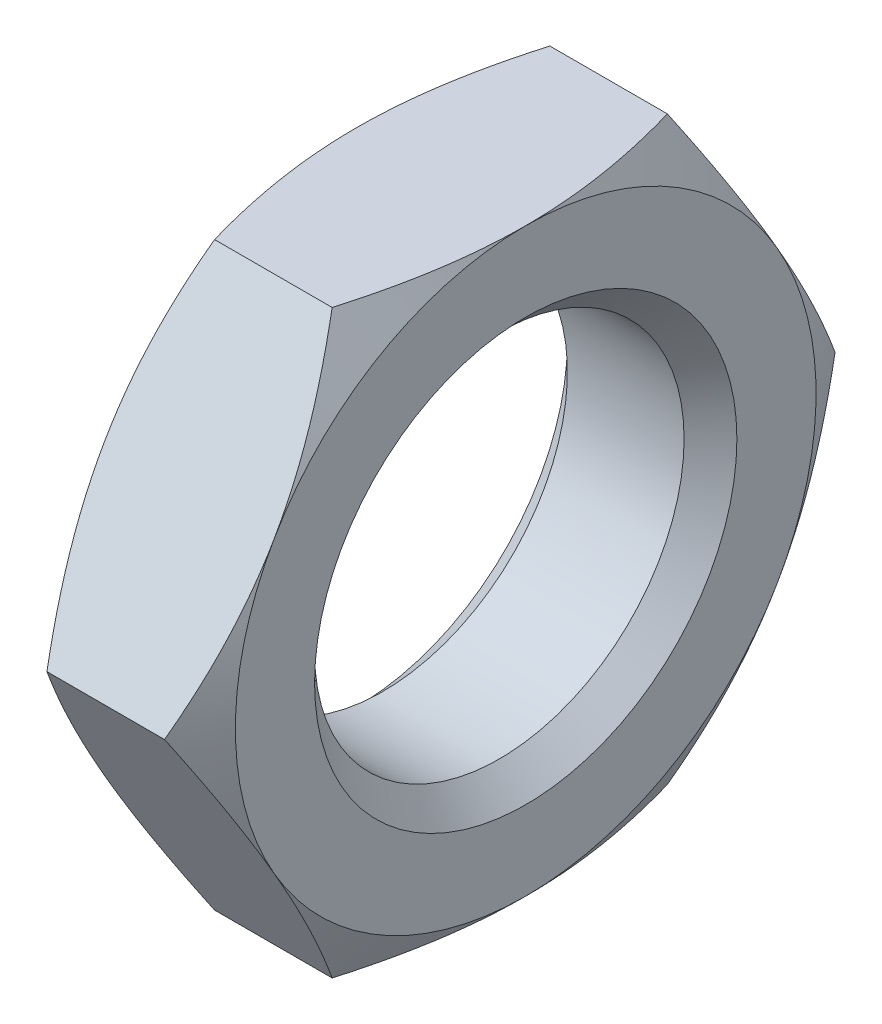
ISO-10303-21;
HEADER;
FILE_DESCRIPTION(('STEP AP214'),'2;1');
FILE_NAME('part.step','',(''),(''),'','','');
FILE_SCHEMA(('AUTOMOTIVE_DESIGN { 1 0 10303 214 1 1 1 1 }'));
ENDSEC;
DATA;
#1=APPLICATION_CONTEXT('core data for automotive mechanical design processes');
#2=APPLICATION_PROTOCOL_DEFINITION('international standard','automotive_design',2000,#1);
#3=PRODUCT_CONTEXT('',#1,'mechanical');
#4=PRODUCT('Part','Part','',(#3));
#5=PRODUCT_RELATED_PRODUCT_CATEGORY('part','',(#4));
#6=PRODUCT_DEFINITION_FORMATION('','',#4);
#7=PRODUCT_DEFINITION_CONTEXT('part definition',#1,'design');
#8=PRODUCT_DEFINITION('design','',#6,#7);
#9=PRODUCT_DEFINITION_SHAPE('','',#8);
#10=(LENGTH_UNIT() NAMED_UNIT(*) SI_UNIT(.MILLI.,.METRE.));
#11=(NAMED_UNIT(*) PLANE_ANGLE_UNIT() SI_UNIT($,.RADIAN.));
#12=(NAMED_UNIT(*) SI_UNIT($,.STERADIAN.) SOLID_ANGLE_UNIT());
#13=UNCERTAINTY_MEASURE_WITH_UNIT(LENGTH_MEASURE(1.E-05),#10,'distance_accuracy_value','');
#14=(GEOMETRIC_REPRESENTATION_CONTEXT(3) GLOBAL_UNCERTAINTY_ASSIGNED_CONTEXT((#13)) GLOBAL_UNIT_ASSIGNED_CONTEXT((#10,
#11,#12)) REPRESENTATION_CONTEXT('',''));
#15=CARTESIAN_POINT('',(0.,0.,0.));
#16=DIRECTION('',(0.,0.,1.));
#17=DIRECTION('',(1.,0.,0.));
#18=AXIS2_PLACEMENT_3D('',#15,#16,#17);
#19=CARTESIAN_POINT('',(6.42,11.,-6.35085296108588));
#20=DIRECTION('',(1.,0.,0.));
#21=DIRECTION('',(0.,0.,-1.));
#22=AXIS2_PLACEMENT_3D('',#19,#20,#21);
#23=PLANE('',#22);
#24=CARTESIAN_POINT('',(6.42,0.,0.));
#25=DIRECTION('',(1.,0.,0.));
#26=DIRECTION('',(0.,0.,-1.));
#27=AXIS2_PLACEMENT_3D('',#24,#25,#26);
#28=CIRCLE('',#27,8.00000000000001);
#29=CARTESIAN_POINT('',(6.42,0.,-8.00000000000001));
#30=VERTEX_POINT('',#29);
#31=EDGE_CURVE('E11',#30,#30,#28,.F.);
#32=ORIENTED_EDGE('',*,*,#31,.T.);
#33=EDGE_LOOP('',(#32));
#34=FACE_BOUND('',#33,.T.);
#35=CARTESIAN_POINT('',(6.42,0.,0.));
#36=DIRECTION('',(1.,0.,0.));
#37=DIRECTION('',(0.,0.,-1.));
#38=AXIS2_PLACEMENT_3D('',#35,#36,#37);
#39=CIRCLE('',#38,11.);
#40=CARTESIAN_POINT('',(6.42,-11.,0.));
#41=VERTEX_POINT('',#40);
#42=CARTESIAN_POINT('',(6.42,-5.50000000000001,-9.52627944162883));
#43=VERTEX_POINT('',#42);
#44=EDGE_CURVE('E142',#41,#43,#39,.T.);
#45=ORIENTED_EDGE('',*,*,#44,.T.);
#46=CARTESIAN_POINT('',(6.42,5.5,-9.52627944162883));
#47=VERTEX_POINT('',#46);
#48=EDGE_CURVE('E130',#43,#47,#39,.T.);
#49=ORIENTED_EDGE('',*,*,#48,.T.);
#50=CARTESIAN_POINT('',(6.42,11.,0.));
#51=VERTEX_POINT('',#50);
#52=EDGE_CURVE('E144',#47,#51,#39,.T.);
#53=ORIENTED_EDGE('',*,*,#52,.T.);
#54=CARTESIAN_POINT('',(6.42,5.5,9.52627944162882));
#55=VERTEX_POINT('',#54);
#56=EDGE_CURVE('E55',#51,#55,#39,.T.);
#57=ORIENTED_EDGE('',*,*,#56,.T.);
#58=CARTESIAN_POINT('',(6.42,-5.5,9.52627944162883));
#59=VERTEX_POINT('',#58);
#60=EDGE_CURVE('E63',#55,#59,#39,.T.);
#61=ORIENTED_EDGE('',*,*,#60,.T.);
#62=EDGE_CURVE('E166',#59,#41,#39,.T.);
#63=ORIENTED_EDGE('',*,*,#62,.T.);
#64=EDGE_LOOP('',(#45,#49,#53,#57,#61,#63));
#65=FACE_BOUND('',#64,.T.);
#66=ADVANCED_FACE('F39',(#34,#65),#23,.T.);
#67=CARTESIAN_POINT('',(0.,11.,-6.35085296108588));
#68=DIRECTION('',(1.,0.,0.));
#69=DIRECTION('',(0.,0.,-1.));
#70=AXIS2_PLACEMENT_3D('',#67,#68,#69);
#71=PLANE('',#70);
#72=CARTESIAN_POINT('',(0.,0.,0.));
#73=DIRECTION('',(1.,0.,0.));
#74=DIRECTION('',(0.,0.,-1.));
#75=AXIS2_PLACEMENT_3D('',#72,#73,#74);
#76=CIRCLE('',#75,7.99999999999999);
#77=CARTESIAN_POINT('',(0.,0.,-7.99999999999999));
#78=VERTEX_POINT('',#77);
#79=EDGE_CURVE('E164',#78,#78,#76,.T.);
#80=ORIENTED_EDGE('',*,*,#79,.T.);
#81=EDGE_LOOP('',(#80));
#82=FACE_BOUND('',#81,.T.);
#83=CARTESIAN_POINT('',(0.,0.,0.));
#84=DIRECTION('',(1.,0.,0.));
#85=DIRECTION('',(0.,0.,-1.));
#86=AXIS2_PLACEMENT_3D('',#83,#84,#85);
#87=CIRCLE('',#86,11.);
#88=CARTESIAN_POINT('',(0.,-5.5,-9.52627944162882));
#89=VERTEX_POINT('',#88);
#90=CARTESIAN_POINT('',(0.,5.50000000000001,-9.52627944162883));
#91=VERTEX_POINT('',#90);
#92=EDGE_CURVE('E173',#89,#91,#87,.T.);
#93=ORIENTED_EDGE('',*,*,#92,.F.);
#94=CARTESIAN_POINT('',(0.,-11.,0.));
#95=VERTEX_POINT('',#94);
#96=EDGE_CURVE('E321',#95,#89,#87,.T.);
#97=ORIENTED_EDGE('',*,*,#96,.F.);
#98=CARTESIAN_POINT('',(0.,-5.5,9.52627944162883));
#99=VERTEX_POINT('',#98);
#100=EDGE_CURVE('E324',#99,#95,#87,.T.);
#101=ORIENTED_EDGE('',*,*,#100,.F.);
#102=CARTESIAN_POINT('',(0.,5.5,9.52627944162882));
#103=VERTEX_POINT('',#102);
#104=EDGE_CURVE('E327',#103,#99,#87,.T.);
#105=ORIENTED_EDGE('',*,*,#104,.F.);
#106=CARTESIAN_POINT('',(0.,11.,0.));
#107=VERTEX_POINT('',#106);
#108=EDGE_CURVE('E178',#107,#103,#87,.T.);
#109=ORIENTED_EDGE('',*,*,#108,.F.);
#110=EDGE_CURVE('E174',#91,#107,#87,.T.);
#111=ORIENTED_EDGE('',*,*,#110,.F.);
#112=EDGE_LOOP('',(#93,#97,#101,#105,#109,#111));
#113=FACE_BOUND('',#112,.T.);
#114=ADVANCED_FACE('F322',(#82,#113),#71,.F.);
#115=CARTESIAN_POINT('',(6.42,0.,0.));
#116=DIRECTION('',(-1.,0.,0.));
#117=DIRECTION('',(0.,0.,1.));
#118=AXIS2_PLACEMENT_3D('',#115,#116,#117);
#119=CYLINDRICAL_SURFACE('',#118,7.);
#120=CARTESIAN_POINT('',(0.999999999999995,0.,0.));
#121=DIRECTION('',(1.,0.,0.));
#122=DIRECTION('',(0.,0.,-1.));
#123=AXIS2_PLACEMENT_3D('',#120,#121,#122);
#124=CIRCLE('',#123,7.);
#125=CARTESIAN_POINT('',(0.999999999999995,0.,7.));
#126=VERTEX_POINT('',#125);
#127=EDGE_CURVE('E48',#126,#126,#124,.F.);
#128=CARTESIAN_POINT('',(5.41999999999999,0.,0.));
#129=DIRECTION('',(1.,0.,0.));
#130=DIRECTION('',(0.,0.,-1.));
#131=AXIS2_PLACEMENT_3D('',#128,#129,#130);
#132=CIRCLE('',#131,7.);
#133=CARTESIAN_POINT('',(5.41999999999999,0.,7.));
#134=VERTEX_POINT('',#133);
#135=EDGE_CURVE('E410',#134,#134,#132,.T.);
#136=CARTESIAN_POINT('',(0.999999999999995,0.,7.));
#137=CARTESIAN_POINT('',(1.04604166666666,0.,7.));
#138=CARTESIAN_POINT('',(1.09208333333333,0.,7.));
#139=CARTESIAN_POINT('',(1.18416666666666,0.,7.));
#140=CARTESIAN_POINT('',(1.23020833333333,0.,7.));
#141=CARTESIAN_POINT('',(1.32229166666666,0.,7.));
#142=CARTESIAN_POINT('',(1.36833333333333,0.,7.));
#143=CARTESIAN_POINT('',(1.46041666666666,0.,7.));
#144=CARTESIAN_POINT('',(1.50645833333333,0.,7.));
#145=CARTESIAN_POINT('',(1.59854166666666,0.,7.));
#146=CARTESIAN_POINT('',(1.64458333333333,0.,7.));
#147=CARTESIAN_POINT('',(1.73666666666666,0.,7.));
#148=CARTESIAN_POINT('',(1.78270833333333,0.,7.));
#149=CARTESIAN_POINT('',(1.87479166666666,0.,7.));
#150=CARTESIAN_POINT('',(1.92083333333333,0.,7.));
#151=CARTESIAN_POINT('',(2.01291666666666,0.,7.));
#152=CARTESIAN_POINT('',(2.05895833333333,0.,7.));
#153=CARTESIAN_POINT('',(2.15104166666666,0.,7.));
#154=CARTESIAN_POINT('',(2.19708333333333,0.,7.));
#155=CARTESIAN_POINT('',(2.28916666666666,0.,7.));
#156=CARTESIAN_POINT('',(2.33520833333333,0.,7.));
#157=CARTESIAN_POINT('',(2.42729166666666,0.,7.));
#158=CARTESIAN_POINT('',(2.47333333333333,0.,7.));
#159=CARTESIAN_POINT('',(2.56541666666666,0.,7.));
#160=CARTESIAN_POINT('',(2.61145833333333,0.,7.));
#161=CARTESIAN_POINT('',(2.70354166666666,0.,7.));
#162=CARTESIAN_POINT('',(2.74958333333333,0.,7.));
#163=CARTESIAN_POINT('',(2.84166666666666,0.,7.));
#164=CARTESIAN_POINT('',(2.88770833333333,0.,7.));
#165=CARTESIAN_POINT('',(2.97979166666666,0.,7.));
#166=CARTESIAN_POINT('',(3.02583333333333,0.,7.));
#167=CARTESIAN_POINT('',(3.11791666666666,0.,7.));
#168=CARTESIAN_POINT('',(3.16395833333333,0.,7.));
#169=CARTESIAN_POINT('',(3.25604166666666,0.,7.));
#170=CARTESIAN_POINT('',(3.30208333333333,0.,7.));
#171=CARTESIAN_POINT('',(3.39416666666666,0.,7.));
#172=CARTESIAN_POINT('',(3.44020833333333,0.,7.));
#173=CARTESIAN_POINT('',(3.53229166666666,0.,7.));
#174=CARTESIAN_POINT('',(3.57833333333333,0.,7.));
#175=CARTESIAN_POINT('',(3.67041666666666,0.,7.));
#176=CARTESIAN_POINT('',(3.71645833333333,0.,7.));
#177=CARTESIAN_POINT('',(3.80854166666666,0.,7.));
#178=CARTESIAN_POINT('',(3.85458333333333,0.,7.));
#179=CARTESIAN_POINT('',(3.94666666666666,0.,7.));
#180=CARTESIAN_POINT('',(3.99270833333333,0.,7.));
#181=CARTESIAN_POINT('',(4.08479166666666,0.,7.));
#182=CARTESIAN_POINT('',(4.13083333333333,0.,7.));
#183=CARTESIAN_POINT('',(4.22291666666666,0.,7.));
#184=CARTESIAN_POINT('',(4.26895833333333,0.,7.));
#185=CARTESIAN_POINT('',(4.36104166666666,0.,7.));
#186=CARTESIAN_POINT('',(4.40708333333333,0.,7.));
#187=CARTESIAN_POINT('',(4.49916666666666,0.,7.));
#188=CARTESIAN_POINT('',(4.54520833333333,0.,7.));
#189=CARTESIAN_POINT('',(4.63729166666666,0.,7.));
#190=CARTESIAN_POINT('',(4.68333333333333,0.,7.));
#191=CARTESIAN_POINT('',(4.77541666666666,0.,7.));
#192=CARTESIAN_POINT('',(4.82145833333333,0.,7.));
#193=CARTESIAN_POINT('',(4.91354166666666,0.,7.));
#194=CARTESIAN_POINT('',(4.95958333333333,0.,7.));
#195=CARTESIAN_POINT('',(5.05166666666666,0.,7.));
#196=CARTESIAN_POINT('',(5.09770833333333,0.,7.));
#197=CARTESIAN_POINT('',(5.18979166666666,0.,7.));
#198=CARTESIAN_POINT('',(5.23583333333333,0.,7.));
#199=CARTESIAN_POINT('',(5.32791666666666,0.,7.));
#200=CARTESIAN_POINT('',(5.37395833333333,0.,7.));
#201=CARTESIAN_POINT('',(5.41999999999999,0.,7.));
#202=B_SPLINE_CURVE_WITH_KNOTS('',3,(#136,#137,#138,#139,#140,#141,#142,#143,#144,#145,#146,
#147,#148,#149,#150,#151,#152,#153,#154,#155,#156,#157,#158,#159,#160,#161,#162,#163,#164,#165,
#166,#167,#168,#169,#170,#171,#172,#173,#174,#175,#176,#177,#178,#179,#180,#181,#182,#183,#184,
#185,#186,#187,#188,#189,#190,#191,#192,#193,#194,#195,#196,#197,#198,#199,#200,#201),
.UNSPECIFIED.,.F.,.F.,(4,2,2,2,2,2,2,2,2,2,2,2,2,2,2,2,2,2,2,2,2,2,2,2,2,2,2,2,2,2,2,2,4),(0.,
0.138125,0.27625,0.414375,0.5525,0.690625,0.82875,0.966875,1.105,1.243125,1.38125,1.519375,
1.6575,1.795625,1.93375,2.071875,2.21,2.348125,2.48625,2.624375,2.7625,2.900625,3.03875,
3.176875,3.315,3.453125,3.59125,3.729375,3.8675,4.005625,4.14375,4.281875,4.42),.UNSPECIFIED.);
#203=EDGE_CURVE('BSEAM234',#126,#134,#202,.T.);
#204=ORIENTED_EDGE('',*,*,#127,.T.);
#205=ORIENTED_EDGE('',*,*,#135,.T.);
#206=ORIENTED_EDGE('',*,*,#203,.T.);
#207=ORIENTED_EDGE('',*,*,#203,.F.);
#208=EDGE_LOOP('',(#204,#206,#205,#207));
#209=FACE_BOUND('',#208,.T.);
#210=ADVANCED_FACE('F234',(#209),#119,.F.);
#211=CARTESIAN_POINT('',(0.,0.,0.));
#212=DIRECTION('',(1.,0.,0.));
#213=DIRECTION('',(0.,0.,-1.));
#214=AXIS2_PLACEMENT_3D('',#211,#212,#213);
#215=CONICAL_SURFACE('',#214,11.,1.0471975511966);
#216=CARTESIAN_POINT('',(0.982547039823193,-11.0002,-6.35073749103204));
#217=CARTESIAN_POINT('',(0.901959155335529,-10.7583962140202,-6.49034297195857));
#218=CARTESIAN_POINT('',(0.825028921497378,-10.515690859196,-6.63046897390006));
#219=CARTESIAN_POINT('',(0.679498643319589,-10.0283338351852,-6.91184468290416));
#220=CARTESIAN_POINT('',(0.610901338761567,-9.78368155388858,-7.05309474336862));
#221=CARTESIAN_POINT('',(0.418936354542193,-9.0457826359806,-7.47912088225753));
#222=CARTESIAN_POINT('',(0.309747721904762,-8.54962304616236,-7.7655787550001));
#223=CARTESIAN_POINT('',(0.181714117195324,-7.80714296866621,-8.19424982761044));
#224=CARTESIAN_POINT('',(0.145242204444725,-7.56304065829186,-8.33518236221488));
#225=CARTESIAN_POINT('',(0.0840813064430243,-7.07370581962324,-8.61769996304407));
#226=CARTESIAN_POINT('',(0.0593925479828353,-6.82847326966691,-8.75928504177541));
#227=CARTESIAN_POINT('',(0.0224303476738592,-6.33759931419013,-9.04269125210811));
#228=CARTESIAN_POINT('',(0.0101421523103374,-6.0919587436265,-9.18451190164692));
#229=CARTESIAN_POINT('',(-0.00175707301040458,-5.60044998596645,-9.468284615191));
#230=CARTESIAN_POINT('',(-0.00136849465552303,-5.35458180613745,-9.61023667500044));
#231=CARTESIAN_POINT('',(0.011201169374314,-4.89492981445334,-9.87561687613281));
#232=CARTESIAN_POINT('',(0.0218490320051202,-4.68111322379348,-9.99906394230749));
#233=CARTESIAN_POINT('',(0.0525316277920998,-4.25397181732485,-10.2456741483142));
#234=CARTESIAN_POINT('',(0.0725670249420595,-4.04064703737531,-10.3688372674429));
#235=CARTESIAN_POINT('',(0.121675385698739,-3.6146051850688,-10.6148126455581));
#236=CARTESIAN_POINT('',(0.150755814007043,-3.4018887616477,-10.7376245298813));
#237=CARTESIAN_POINT('',(0.217443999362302,-2.97745318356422,-10.9826725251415));
#238=CARTESIAN_POINT('',(0.255052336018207,-2.76573409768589,-11.1049085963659));
#239=CARTESIAN_POINT('',(0.381619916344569,-2.12304886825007,-11.4759630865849));
#240=CARTESIAN_POINT('',(0.483199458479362,-1.69394387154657,-11.7237069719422));
#241=CARTESIAN_POINT('',(0.713743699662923,-0.842132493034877,-12.2155005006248));
#242=CARTESIAN_POINT('',(0.842654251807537,-0.419415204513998,-12.4595564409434));
#243=CARTESIAN_POINT('',(0.982547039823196,0.000200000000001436,-12.7018213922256));
#244=B_SPLINE_CURVE_WITH_KNOTS('',3,(#216,#217,#218,#219,#220,#221,#222,#223,#224,#225,#226,
#227,#228,#229,#230,#231,#232,#233,#234,#235,#236,#237,#238,#239,#240,#241,#242,#243),
.UNSPECIFIED.,.F.,.F.,(4,2,2,2,2,2,2,2,2,2,2,2,2,4),(0.,0.871755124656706,1.74379610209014,
3.49159027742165,4.34403665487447,5.19649943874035,6.0479468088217,6.89936787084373,
7.64056020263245,8.38180496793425,9.1236630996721,9.86557166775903,11.3820155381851,
12.8954827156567),.UNSPECIFIED.);
#245=CARTESIAN_POINT('',(0.982480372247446,0.,-12.7017059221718));
#246=VERTEX_POINT('',#245);
#247=EDGE_CURVE('E335',#89,#246,#244,.T.);
#248=ORIENTED_EDGE('',*,*,#247,.F.);
#249=ORIENTED_EDGE('',*,*,#92,.T.);
#250=CARTESIAN_POINT('',(0.982547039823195,-0.000199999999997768,-12.7018213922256));
#251=CARTESIAN_POINT('',(0.901959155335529,0.241603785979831,-12.5622159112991));
#252=CARTESIAN_POINT('',(0.825028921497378,0.484309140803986,-12.4220899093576));
#253=CARTESIAN_POINT('',(0.679498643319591,0.971666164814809,-12.1407142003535));
#254=CARTESIAN_POINT('',(0.61090133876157,1.21631844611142,-11.999464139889));
#255=CARTESIAN_POINT('',(0.418936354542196,1.9542173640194,-11.5734380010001));
#256=CARTESIAN_POINT('',(0.309747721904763,2.45037695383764,-11.2869801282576));
#257=CARTESIAN_POINT('',(0.181714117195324,3.19285703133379,-10.8583090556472));
#258=CARTESIAN_POINT('',(0.145242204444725,3.43695934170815,-10.7173765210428));
#259=CARTESIAN_POINT('',(0.0840813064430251,3.92629418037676,-10.4348589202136));
#260=CARTESIAN_POINT('',(0.0593925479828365,4.17152673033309,-10.2932738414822));
#261=CARTESIAN_POINT('',(0.02243034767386,4.66240068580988,-10.0098676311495));
#262=CARTESIAN_POINT('',(0.0101421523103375,4.90804125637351,-9.86804698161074));
#263=CARTESIAN_POINT('',(-0.00175707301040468,5.39955001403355,-9.58427426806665));
#264=CARTESIAN_POINT('',(-0.00136849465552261,5.64541819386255,-9.44232220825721));
#265=CARTESIAN_POINT('',(0.0112011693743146,6.10507018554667,-9.17694200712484));
#266=CARTESIAN_POINT('',(0.0218490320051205,6.31888677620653,-9.05349494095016));
#267=CARTESIAN_POINT('',(0.0525316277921,6.74602818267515,-8.80688473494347));
#268=CARTESIAN_POINT('',(0.07256702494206,6.95935296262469,-8.68372161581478));
#269=CARTESIAN_POINT('',(0.121675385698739,7.3853948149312,-8.43774623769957));
#270=CARTESIAN_POINT('',(0.150755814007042,7.5981112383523,-8.31493435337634));
#271=CARTESIAN_POINT('',(0.217443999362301,8.02254681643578,-8.0698863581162));
#272=CARTESIAN_POINT('',(0.255052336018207,8.23426590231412,-7.94765028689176));
#273=CARTESIAN_POINT('',(0.381619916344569,8.87695113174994,-7.57659579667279));
#274=CARTESIAN_POINT('',(0.483199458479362,9.30605612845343,-7.32885191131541));
#275=CARTESIAN_POINT('',(0.713743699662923,10.1578675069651,-6.8370583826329));
#276=CARTESIAN_POINT('',(0.842654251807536,10.580584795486,-6.59300244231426));
#277=CARTESIAN_POINT('',(0.982547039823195,11.0002,-6.35073749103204));
#278=B_SPLINE_CURVE_WITH_KNOTS('',3,(#250,#251,#252,#253,#254,#255,#256,#257,#258,#259,#260,
#261,#262,#263,#264,#265,#266,#267,#268,#269,#270,#271,#272,#273,#274,#275,#276,#277),
.UNSPECIFIED.,.F.,.F.,(4,2,2,2,2,2,2,2,2,2,2,2,2,4),(0.,0.871755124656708,1.74379610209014,
3.49159027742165,4.34403665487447,5.19649943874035,6.0479468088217,6.89936787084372,
7.64056020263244,8.38180496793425,9.1236630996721,9.86557166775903,11.3820155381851,
12.8954827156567),.UNSPECIFIED.);
#279=EDGE_CURVE('E215',#246,#91,#278,.T.);
#280=ORIENTED_EDGE('',*,*,#279,.F.);
#281=EDGE_LOOP('',(#248,#249,#280));
#282=FACE_BOUND('',#281,.T.);
#283=ADVANCED_FACE('F194',(#282),#215,.T.);
#284=ORIENTED_EDGE('',*,*,#96,.T.);
#285=CARTESIAN_POINT('',(0.982480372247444,-11.,-6.35085296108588));
#286=VERTEX_POINT('',#285);
#287=EDGE_CURVE('E156',#286,#89,#244,.T.);
#288=ORIENTED_EDGE('',*,*,#287,.F.);
#289=CARTESIAN_POINT('',(5.41450441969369,-11.,-17.1543260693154));
#290=CARTESIAN_POINT('',(5.29756728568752,-11.,-16.9137160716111));
#291=CARTESIAN_POINT('',(5.18120609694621,-11.,-16.6728262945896));
#292=CARTESIAN_POINT('',(4.94976586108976,-11.,-16.1904288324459));
#293=CARTESIAN_POINT('',(4.83468682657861,-11.,-15.9489211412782));
#294=CARTESIAN_POINT('',(4.49153861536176,-11.,-15.2233206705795));
#295=CARTESIAN_POINT('',(4.26559230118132,-11.,-14.7382202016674));
#296=CARTESIAN_POINT('',(3.81951265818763,-11.,-13.7622100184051));
#297=CARTESIAN_POINT('',(3.59941685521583,-11.,-13.2712831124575));
#298=CARTESIAN_POINT('',(3.16810209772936,-11.,-12.2855584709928));
#299=CARTESIAN_POINT('',(2.95688273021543,-11.,-11.7907609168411));
#300=CARTESIAN_POINT('',(2.53890093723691,-11.,-10.7801499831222));
#301=CARTESIAN_POINT('',(2.33251361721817,-11.,-10.2641806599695));
#302=CARTESIAN_POINT('',(1.93512913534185,-11.,-9.2262370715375));
#303=CARTESIAN_POINT('',(1.74413368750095,-11.,-8.70426214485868));
#304=CARTESIAN_POINT('',(1.38248046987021,-11.,-7.65444043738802));
#305=CARTESIAN_POINT('',(1.21178233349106,-11.,-7.1266076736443));
#306=CARTESIAN_POINT('',(0.896128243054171,-11.,-6.06332116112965));
#307=CARTESIAN_POINT('',(0.751164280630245,-11.,-5.52786983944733));
#308=CARTESIAN_POINT('',(0.558616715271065,-11.,-4.72037006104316));
#309=CARTESIAN_POINT('',(0.49871693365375,-11.,-4.45124120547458));
#310=CARTESIAN_POINT('',(0.387920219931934,-11.,-3.91112703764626));
#311=CARTESIAN_POINT('',(0.337023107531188,-11.,-3.64014176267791));
#312=CARTESIAN_POINT('',(0.24512419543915,-11.,-3.09649461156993));
#313=CARTESIAN_POINT('',(0.204122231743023,-11.,-2.8238327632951));
#314=CARTESIAN_POINT('',(0.132827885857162,-11.,-2.27711361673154));
#315=CARTESIAN_POINT('',(0.102535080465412,-11.,-2.00305637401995));
#316=CARTESIAN_POINT('',(0.0536460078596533,-11.,-1.45754881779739));
#317=CARTESIAN_POINT('',(0.0349003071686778,-11.,-1.18611197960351));
#318=CARTESIAN_POINT('',(0.00890949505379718,-11.,-0.642689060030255));
#319=CARTESIAN_POINT('',(0.00166419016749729,-11.,-0.370702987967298));
#320=CARTESIAN_POINT('',(-0.00115304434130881,-11.,0.173331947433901));
#321=CARTESIAN_POINT('',(0.00327503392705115,-11.,0.445380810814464));
#322=CARTESIAN_POINT('',(0.0236951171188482,-11.,0.989047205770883));
#323=CARTESIAN_POINT('',(0.039687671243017,-11.,1.26066471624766));
#324=CARTESIAN_POINT('',(0.0914497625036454,-11.,1.91059229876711));
#325=CARTESIAN_POINT('',(0.132547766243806,-11.,2.28848722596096));
#326=CARTESIAN_POINT('',(0.234907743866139,-11.,3.0415166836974));
#327=CARTESIAN_POINT('',(0.296172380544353,-11.,3.41665084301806));
#328=CARTESIAN_POINT('',(0.506971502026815,-11.,4.53745976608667));
#329=CARTESIAN_POINT('',(0.683474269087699,-11.,5.27813200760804));
#330=CARTESIAN_POINT('',(0.990112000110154,-11.,6.38572900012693));
#331=CARTESIAN_POINT('',(1.10074350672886,-11.,6.7583843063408));
#332=CARTESIAN_POINT('',(1.33364120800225,-11.,7.50007701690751));
#333=CARTESIAN_POINT('',(1.45590748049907,-11.,7.86911439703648));
#334=CARTESIAN_POINT('',(1.71010110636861,-11.,8.60368413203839));
#335=CARTESIAN_POINT('',(1.84202537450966,-11.,8.96921756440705));
#336=CARTESIAN_POINT('',(2.11396847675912,-11.,9.69724662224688));
#337=CARTESIAN_POINT('',(2.25398720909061,-11.,10.0597422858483));
#338=CARTESIAN_POINT('',(2.59745413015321,-11.,10.9247708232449));
#339=CARTESIAN_POINT('',(2.80410126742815,-11.,11.4260312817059));
#340=CARTESIAN_POINT('',(3.22770231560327,-11.,12.4241916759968));
#341=CARTESIAN_POINT('',(3.44465690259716,-11.,12.9210913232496));
#342=CARTESIAN_POINT('',(3.88677852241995,-11.,13.9113565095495));
#343=CARTESIAN_POINT('',(4.11194751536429,-11.,14.4047211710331));
#344=CARTESIAN_POINT('',(4.56881488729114,-11.,15.3883964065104));
#345=CARTESIAN_POINT('',(4.80051311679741,-11.,15.8787070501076));
#346=CARTESIAN_POINT('',(5.26947068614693,-11.,16.8573519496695));
#347=CARTESIAN_POINT('',(5.5067361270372,-11.,17.3456832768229));
#348=CARTESIAN_POINT('',(5.98560771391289,-11.,18.3202126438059));
#349=CARTESIAN_POINT('',(6.22721387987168,-11.,18.8064106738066));
#350=CARTESIAN_POINT('',(6.71397943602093,-11.,19.776938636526));
#351=CARTESIAN_POINT('',(6.95913832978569,-11.,20.2612688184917));
#352=CARTESIAN_POINT('',(7.45245334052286,-11.,21.2284012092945));
#353=CARTESIAN_POINT('',(7.70060946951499,-11.,21.7112034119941));
#354=CARTESIAN_POINT('',(8.40600546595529,-11.,23.0748433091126));
#355=CARTESIAN_POINT('',(8.86618755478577,-11.,23.9541589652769));
#356=CARTESIAN_POINT('',(9.79280986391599,-11.,25.7095213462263));
#357=CARTESIAN_POINT('',(10.259250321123,-11.,26.5855679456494));
#358=CARTESIAN_POINT('',(11.195689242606,-11.,28.3328196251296));
#359=CARTESIAN_POINT('',(11.6656752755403,-11.,29.2040313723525));
#360=CARTESIAN_POINT('',(12.3734262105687,-11.,30.5093118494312));
#361=CARTESIAN_POINT('',(12.6097984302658,-11.,30.9441368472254));
#362=CARTESIAN_POINT('',(13.0833739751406,-11.,31.8133331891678));
#363=CARTESIAN_POINT('',(13.3205772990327,-11.,32.2477045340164));
#364=CARTESIAN_POINT('',(13.5581479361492,-11.,32.6818749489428));
#365=B_SPLINE_CURVE_WITH_KNOTS('',3,(#289,#290,#291,#292,#293,#294,#295,#296,#297,#298,#299,
#300,#301,#302,#303,#304,#305,#306,#307,#308,#309,#310,#311,#312,#313,#314,#315,#316,#317,#318,
#319,#320,#321,#322,#323,#324,#325,#326,#327,#328,#329,#330,#331,#332,#333,#334,#335,#336,#337,
#338,#339,#340,#341,#342,#343,#344,#345,#346,#347,#348,#349,#350,#351,#352,#353,#354,#355,#356,
#357,#358,#359,#360,#361,#362,#363,#364),.UNSPECIFIED.,.F.,.F.,(4,2,2,2,2,2,2,2,2,2,2,2,2,2,2,2,
2,2,2,2,2,2,2,2,2,2,2,2,2,2,2,2,2,2,2,2,2,4),(0.,0.802561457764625,1.60513079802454,
3.21050209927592,4.8244541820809,6.43833108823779,8.10529101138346,9.77243630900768,
11.4362085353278,13.0994620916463,13.9264785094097,14.7534783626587,15.5804645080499,
16.4074179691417,17.2234315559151,18.0394314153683,18.8554318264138,19.6714709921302,
20.8111983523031,21.9510762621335,24.2320584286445,25.3981500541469,26.5642494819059,
27.7299780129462,28.8956918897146,30.5220914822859,32.1485979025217,33.7754950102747,
35.4023549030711,37.0310896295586,38.6598318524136,40.2883486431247,41.9168719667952,
44.894193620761,47.87162829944,50.841308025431,52.3260637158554,53.8108171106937),.UNSPECIFIED.);
#366=EDGE_CURVE('E177',#95,#286,#365,.F.);
#367=ORIENTED_EDGE('',*,*,#366,.F.);
#368=EDGE_LOOP('',(#284,#288,#367));
#369=FACE_BOUND('',#368,.T.);
#370=ADVANCED_FACE('F354',(#369),#215,.T.);
#371=CARTESIAN_POINT('',(3.21,0.,0.));
#372=DIRECTION('',(-1.,0.,0.));
#373=DIRECTION('',(0.,0.,1.));
#374=AXIS2_PLACEMENT_3D('',#371,#372,#373);
#375=CONICAL_SURFACE('',#374,16.5598830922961,1.0471975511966);
#376=CARTESIAN_POINT('',(5.4374529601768,0.000200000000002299,-12.7018213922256));
#377=CARTESIAN_POINT('',(5.51804084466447,-0.241603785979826,-12.5622159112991));
#378=CARTESIAN_POINT('',(5.59497107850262,-0.484309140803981,-12.4220899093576));
#379=CARTESIAN_POINT('',(5.74050135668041,-0.971666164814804,-12.1407142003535));
#380=CARTESIAN_POINT('',(5.80909866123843,-1.21631844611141,-11.999464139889));
#381=CARTESIAN_POINT('',(6.0010636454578,-1.9542173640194,-11.5734380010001));
#382=CARTESIAN_POINT('',(6.11025227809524,-2.45037695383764,-11.2869801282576));
#383=CARTESIAN_POINT('',(6.23828588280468,-3.19285703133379,-10.8583090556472));
#384=CARTESIAN_POINT('',(6.27475779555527,-3.43695934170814,-10.7173765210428));
#385=CARTESIAN_POINT('',(6.33591869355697,-3.92629418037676,-10.4348589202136));
#386=CARTESIAN_POINT('',(6.36060745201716,-4.17152673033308,-10.2932738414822));
#387=CARTESIAN_POINT('',(6.39756965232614,-4.66240068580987,-10.0098676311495));
#388=CARTESIAN_POINT('',(6.40985784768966,-4.9080412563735,-9.86804698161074));
#389=CARTESIAN_POINT('',(6.4217570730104,-5.39955001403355,-9.58427426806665));
#390=CARTESIAN_POINT('',(6.42136849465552,-5.64541819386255,-9.44232220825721));
#391=CARTESIAN_POINT('',(6.40879883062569,-6.10507018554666,-9.17694200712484));
#392=CARTESIAN_POINT('',(6.39815096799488,-6.31888677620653,-9.05349494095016));
#393=CARTESIAN_POINT('',(6.3674683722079,-6.74602818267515,-8.80688473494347));
#394=CARTESIAN_POINT('',(6.34743297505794,-6.95935296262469,-8.68372161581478));
#395=CARTESIAN_POINT('',(6.29832461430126,-7.3853948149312,-8.43774623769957));
#396=CARTESIAN_POINT('',(6.26924418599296,-7.5981112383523,-8.31493435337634));
#397=CARTESIAN_POINT('',(6.2025560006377,-8.02254681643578,-8.06988635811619));
#398=CARTESIAN_POINT('',(6.16494766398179,-8.23426590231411,-7.94765028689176));
#399=CARTESIAN_POINT('',(6.03838008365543,-8.87695113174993,-7.57659579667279));
#400=CARTESIAN_POINT('',(5.93680054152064,-9.30605612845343,-7.32885191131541));
#401=CARTESIAN_POINT('',(5.70625630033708,-10.1578675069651,-6.8370583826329));
#402=CARTESIAN_POINT('',(5.57734574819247,-10.580584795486,-6.59300244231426));
#403=CARTESIAN_POINT('',(5.43745296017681,-11.0002,-6.35073749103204));
#404=B_SPLINE_CURVE_WITH_KNOTS('',3,(#376,#377,#378,#379,#380,#381,#382,#383,#384,#385,#386,
#387,#388,#389,#390,#391,#392,#393,#394,#395,#396,#397,#398,#399,#400,#401,#402,#403),
.UNSPECIFIED.,.F.,.F.,(4,2,2,2,2,2,2,2,2,2,2,2,2,4),(0.,0.871755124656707,1.74379610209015,
3.49159027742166,4.34403665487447,5.19649943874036,6.0479468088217,6.89936787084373,
7.64056020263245,8.38180496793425,9.12366309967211,9.86557166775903,11.3820155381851,
12.8954827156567),.UNSPECIFIED.);
#405=CARTESIAN_POINT('',(5.43751962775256,-11.,-6.35085296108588));
#406=VERTEX_POINT('',#405);
#407=EDGE_CURVE('E147',#43,#406,#404,.T.);
#408=ORIENTED_EDGE('',*,*,#407,.F.);
#409=ORIENTED_EDGE('',*,*,#44,.F.);
#410=CARTESIAN_POINT('',(1.00549558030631,-11.,-17.1543260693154));
#411=CARTESIAN_POINT('',(1.12243271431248,-11.,-16.9137160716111));
#412=CARTESIAN_POINT('',(1.23879390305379,-11.,-16.6728262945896));
#413=CARTESIAN_POINT('',(1.47023413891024,-11.,-16.1904288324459));
#414=CARTESIAN_POINT('',(1.58531317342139,-11.,-15.9489211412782));
#415=CARTESIAN_POINT('',(1.92846138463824,-11.,-15.2233206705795));
#416=CARTESIAN_POINT('',(2.15440769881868,-11.,-14.7382202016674));
#417=CARTESIAN_POINT('',(2.60048734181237,-11.,-13.7622100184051));
#418=CARTESIAN_POINT('',(2.82058314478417,-11.,-13.2712831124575));
#419=CARTESIAN_POINT('',(3.25189790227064,-11.,-12.2855584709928));
#420=CARTESIAN_POINT('',(3.46311726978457,-11.,-11.7907609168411));
#421=CARTESIAN_POINT('',(3.88109906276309,-11.,-10.7801499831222));
#422=CARTESIAN_POINT('',(4.08748638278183,-11.,-10.2641806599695));
#423=CARTESIAN_POINT('',(4.48487086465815,-11.,-9.2262370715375));
#424=CARTESIAN_POINT('',(4.67586631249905,-11.,-8.70426214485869));
#425=CARTESIAN_POINT('',(5.03751953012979,-11.,-7.65444043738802));
#426=CARTESIAN_POINT('',(5.20821766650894,-11.,-7.1266076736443));
#427=CARTESIAN_POINT('',(5.52387175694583,-11.,-6.06332116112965));
#428=CARTESIAN_POINT('',(5.66883571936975,-11.,-5.52786983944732));
#429=CARTESIAN_POINT('',(5.86138328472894,-11.,-4.72037006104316));
#430=CARTESIAN_POINT('',(5.92128306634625,-11.,-4.45124120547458));
#431=CARTESIAN_POINT('',(6.03207978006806,-11.,-3.91112703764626));
#432=CARTESIAN_POINT('',(6.08297689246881,-11.,-3.64014176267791));
#433=CARTESIAN_POINT('',(6.17487580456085,-11.,-3.09649461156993));
#434=CARTESIAN_POINT('',(6.21587776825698,-11.,-2.8238327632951));
#435=CARTESIAN_POINT('',(6.28717211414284,-11.,-2.27711361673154));
#436=CARTESIAN_POINT('',(6.31746491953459,-11.,-2.00305637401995));
#437=CARTESIAN_POINT('',(6.36635399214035,-11.,-1.45754881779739));
#438=CARTESIAN_POINT('',(6.38509969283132,-11.,-1.18611197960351));
#439=CARTESIAN_POINT('',(6.4110905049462,-11.,-0.642689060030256));
#440=CARTESIAN_POINT('',(6.4183358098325,-11.,-0.3707029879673));
#441=CARTESIAN_POINT('',(6.42115304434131,-11.,0.173331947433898));
#442=CARTESIAN_POINT('',(6.41672496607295,-11.,0.445380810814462));
#443=CARTESIAN_POINT('',(6.39630488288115,-11.,0.989047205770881));
#444=CARTESIAN_POINT('',(6.38031232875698,-11.,1.26066471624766));
#445=CARTESIAN_POINT('',(6.32855023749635,-11.,1.9105922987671));
#446=CARTESIAN_POINT('',(6.28745223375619,-11.,2.28848722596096));
#447=CARTESIAN_POINT('',(6.18509225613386,-11.,3.0415166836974));
#448=CARTESIAN_POINT('',(6.12382761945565,-11.,3.41665084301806));
#449=CARTESIAN_POINT('',(5.91302849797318,-11.,4.53745976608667));
#450=CARTESIAN_POINT('',(5.7365257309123,-11.,5.27813200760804));
#451=CARTESIAN_POINT('',(5.42988799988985,-11.,6.38572900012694));
#452=CARTESIAN_POINT('',(5.31925649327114,-11.,6.7583843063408));
#453=CARTESIAN_POINT('',(5.08635879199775,-11.,7.50007701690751));
#454=CARTESIAN_POINT('',(4.96409251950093,-11.,7.86911439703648));
#455=CARTESIAN_POINT('',(4.70989889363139,-11.,8.60368413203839));
#456=CARTESIAN_POINT('',(4.57797462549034,-11.,8.96921756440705));
#457=CARTESIAN_POINT('',(4.30603152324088,-11.,9.69724662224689));
#458=CARTESIAN_POINT('',(4.16601279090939,-11.,10.0597422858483));
#459=CARTESIAN_POINT('',(3.82254586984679,-11.,10.9247708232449));
#460=CARTESIAN_POINT('',(3.61589873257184,-11.,11.4260312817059));
#461=CARTESIAN_POINT('',(3.19229768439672,-11.,12.4241916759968));
#462=CARTESIAN_POINT('',(2.97534309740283,-11.,12.9210913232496));
#463=CARTESIAN_POINT('',(2.53322147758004,-11.,13.9113565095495));
#464=CARTESIAN_POINT('',(2.30805248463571,-11.,14.4047211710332));
#465=CARTESIAN_POINT('',(1.85118511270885,-11.,15.3883964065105));
#466=CARTESIAN_POINT('',(1.61948688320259,-11.,15.8787070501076));
#467=CARTESIAN_POINT('',(1.15052931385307,-11.,16.8573519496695));
#468=CARTESIAN_POINT('',(0.913263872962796,-11.,17.3456832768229));
#469=CARTESIAN_POINT('',(0.434392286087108,-11.,18.3202126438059));
#470=CARTESIAN_POINT('',(0.192786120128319,-11.,18.8064106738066));
#471=CARTESIAN_POINT('',(-0.293979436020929,-11.,19.776938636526));
#472=CARTESIAN_POINT('',(-0.539138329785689,-11.,20.2612688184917));
#473=CARTESIAN_POINT('',(-1.03245334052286,-11.,21.2284012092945));
#474=CARTESIAN_POINT('',(-1.28060946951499,-11.,21.7112034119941));
#475=CARTESIAN_POINT('',(-1.98600546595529,-11.,23.0748433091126));
#476=CARTESIAN_POINT('',(-2.44618755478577,-11.,23.9541589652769));
#477=CARTESIAN_POINT('',(-3.37280986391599,-11.,25.7095213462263));
#478=CARTESIAN_POINT('',(-3.83925032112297,-11.,26.5855679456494));
#479=CARTESIAN_POINT('',(-4.77568924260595,-11.,28.3328196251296));
#480=CARTESIAN_POINT('',(-5.2456752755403,-11.,29.2040313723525));
#481=CARTESIAN_POINT('',(-5.95342621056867,-11.,30.5093118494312));
#482=CARTESIAN_POINT('',(-6.1897984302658,-11.,30.9441368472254));
#483=CARTESIAN_POINT('',(-6.66337397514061,-11.,31.8133331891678));
#484=CARTESIAN_POINT('',(-6.90057729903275,-11.,32.2477045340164));
#485=CARTESIAN_POINT('',(-7.13814793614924,-11.,32.6818749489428));
#486=B_SPLINE_CURVE_WITH_KNOTS('',3,(#410,#411,#412,#413,#414,#415,#416,#417,#418,#419,#420,
#421,#422,#423,#424,#425,#426,#427,#428,#429,#430,#431,#432,#433,#434,#435,#436,#437,#438,#439,
#440,#441,#442,#443,#444,#445,#446,#447,#448,#449,#450,#451,#452,#453,#454,#455,#456,#457,#458,
#459,#460,#461,#462,#463,#464,#465,#466,#467,#468,#469,#470,#471,#472,#473,#474,#475,#476,#477,
#478,#479,#480,#481,#482,#483,#484,#485),.UNSPECIFIED.,.F.,.F.,(4,2,2,2,2,2,2,2,2,2,2,2,2,2,2,2,
2,2,2,2,2,2,2,2,2,2,2,2,2,2,2,2,2,2,2,2,2,4),(0.,0.802561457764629,1.60513079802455,
3.21050209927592,4.82445418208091,6.43833108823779,8.10529101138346,9.77243630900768,
11.4362085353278,13.0994620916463,13.9264785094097,14.7534783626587,15.5804645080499,
16.4074179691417,17.2234315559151,18.0394314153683,18.8554318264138,19.6714709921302,
20.8111983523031,21.9510762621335,24.2320584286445,25.3981500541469,26.5642494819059,
27.7299780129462,28.8956918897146,30.5220914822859,32.1485979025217,33.7754950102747,
35.4023549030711,37.0310896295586,38.6598318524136,40.2883486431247,41.9168719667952,
44.894193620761,47.87162829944,50.841308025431,52.3260637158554,53.8108171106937),.UNSPECIFIED.);
#487=EDGE_CURVE('E151',#406,#41,#486,.T.);
#488=ORIENTED_EDGE('',*,*,#487,.F.);
#489=EDGE_LOOP('',(#408,#409,#488));
#490=FACE_BOUND('',#489,.T.);
#491=ADVANCED_FACE('F148',(#490),#375,.T.);
#492=ORIENTED_EDGE('',*,*,#48,.F.);
#493=CARTESIAN_POINT('',(5.43751962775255,0.,-12.7017059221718));
#494=VERTEX_POINT('',#493);
#495=EDGE_CURVE('E134',#494,#43,#404,.T.);
#496=ORIENTED_EDGE('',*,*,#495,.F.);
#497=CARTESIAN_POINT('',(5.43745296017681,11.0002,-6.35073749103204));
#498=CARTESIAN_POINT('',(5.51804084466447,10.7583962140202,-6.49034297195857));
#499=CARTESIAN_POINT('',(5.59497107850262,10.515690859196,-6.63046897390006));
#500=CARTESIAN_POINT('',(5.74050135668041,10.0283338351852,-6.91184468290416));
#501=CARTESIAN_POINT('',(5.80909866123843,9.78368155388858,-7.05309474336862));
#502=CARTESIAN_POINT('',(6.0010636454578,9.0457826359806,-7.47912088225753));
#503=CARTESIAN_POINT('',(6.11025227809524,8.54962304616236,-7.7655787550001));
#504=CARTESIAN_POINT('',(6.23828588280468,7.80714296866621,-8.19424982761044));
#505=CARTESIAN_POINT('',(6.27475779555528,7.56304065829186,-8.33518236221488));
#506=CARTESIAN_POINT('',(6.33591869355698,7.07370581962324,-8.61769996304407));
#507=CARTESIAN_POINT('',(6.36060745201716,6.82847326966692,-8.75928504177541));
#508=CARTESIAN_POINT('',(6.39756965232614,6.33759931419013,-9.04269125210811));
#509=CARTESIAN_POINT('',(6.40985784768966,6.0919587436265,-9.18451190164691));
#510=CARTESIAN_POINT('',(6.4217570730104,5.60044998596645,-9.468284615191));
#511=CARTESIAN_POINT('',(6.42136849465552,5.35458180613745,-9.61023667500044));
#512=CARTESIAN_POINT('',(6.40879883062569,4.89492981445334,-9.87561687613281));
#513=CARTESIAN_POINT('',(6.39815096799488,4.68111322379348,-9.99906394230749));
#514=CARTESIAN_POINT('',(6.3674683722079,4.25397181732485,-10.2456741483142));
#515=CARTESIAN_POINT('',(6.34743297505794,4.04064703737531,-10.3688372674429));
#516=CARTESIAN_POINT('',(6.29832461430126,3.6146051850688,-10.6148126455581));
#517=CARTESIAN_POINT('',(6.26924418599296,3.4018887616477,-10.7376245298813));
#518=CARTESIAN_POINT('',(6.2025560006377,2.97745318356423,-10.9826725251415));
#519=CARTESIAN_POINT('',(6.16494766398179,2.76573409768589,-11.1049085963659));
#520=CARTESIAN_POINT('',(6.03838008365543,2.12304886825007,-11.4759630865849));
#521=CARTESIAN_POINT('',(5.93680054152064,1.69394387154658,-11.7237069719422));
#522=CARTESIAN_POINT('',(5.70625630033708,0.842132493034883,-12.2155005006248));
#523=CARTESIAN_POINT('',(5.57734574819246,0.419415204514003,-12.4595564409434));
#524=CARTESIAN_POINT('',(5.4374529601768,-0.000199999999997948,-12.7018213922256));
#525=B_SPLINE_CURVE_WITH_KNOTS('',3,(#497,#498,#499,#500,#501,#502,#503,#504,#505,#506,#507,
#508,#509,#510,#511,#512,#513,#514,#515,#516,#517,#518,#519,#520,#521,#522,#523,#524),
.UNSPECIFIED.,.F.,.F.,(4,2,2,2,2,2,2,2,2,2,2,2,2,4),(0.,0.871755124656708,1.74379610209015,
3.49159027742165,4.34403665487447,5.19649943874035,6.0479468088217,6.89936787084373,
7.64056020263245,8.38180496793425,9.1236630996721,9.86557166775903,11.3820155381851,
12.8954827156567),.UNSPECIFIED.);
#526=EDGE_CURVE('E136',#47,#494,#525,.T.);
#527=ORIENTED_EDGE('',*,*,#526,.F.);
#528=EDGE_LOOP('',(#492,#496,#527));
#529=FACE_BOUND('',#528,.T.);
#530=ADVANCED_FACE('F132',(#529),#375,.T.);
#531=ORIENTED_EDGE('',*,*,#100,.T.);
#532=CARTESIAN_POINT('',(0.982480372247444,-11.,6.35085296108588));
#533=VERTEX_POINT('',#532);
#534=EDGE_CURVE('E187',#533,#95,#365,.F.);
#535=ORIENTED_EDGE('',*,*,#534,.F.);
#536=CARTESIAN_POINT('',(0.982547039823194,0.000200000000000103,12.7018213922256));
#537=CARTESIAN_POINT('',(0.901959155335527,-0.241603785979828,12.5622159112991));
#538=CARTESIAN_POINT('',(0.825028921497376,-0.484309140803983,12.4220899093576));
#539=CARTESIAN_POINT('',(0.679498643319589,-0.971666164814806,12.1407142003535));
#540=CARTESIAN_POINT('',(0.610901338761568,-1.21631844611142,11.999464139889));
#541=CARTESIAN_POINT('',(0.418936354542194,-1.9542173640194,11.5734380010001));
#542=CARTESIAN_POINT('',(0.30974772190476,-2.45037695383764,11.2869801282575));
#543=CARTESIAN_POINT('',(0.181714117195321,-3.19285703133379,10.8583090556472));
#544=CARTESIAN_POINT('',(0.145242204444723,-3.43695934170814,10.7173765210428));
#545=CARTESIAN_POINT('',(0.0840813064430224,-3.92629418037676,10.4348589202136));
#546=CARTESIAN_POINT('',(0.0593925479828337,-4.17152673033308,10.2932738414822));
#547=CARTESIAN_POINT('',(0.0224303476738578,-4.66240068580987,10.0098676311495));
#548=CARTESIAN_POINT('',(0.0101421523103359,-4.9080412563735,9.86804698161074));
#549=CARTESIAN_POINT('',(-0.00175707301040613,-5.39955001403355,9.58427426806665));
#550=CARTESIAN_POINT('',(-0.00136849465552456,-5.64541819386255,9.44232220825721));
#551=CARTESIAN_POINT('',(0.0112011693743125,-6.10507018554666,9.17694200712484));
#552=CARTESIAN_POINT('',(0.0218490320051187,-6.31888677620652,9.05349494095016));
#553=CARTESIAN_POINT('',(0.0525316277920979,-6.74602818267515,8.80688473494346));
#554=CARTESIAN_POINT('',(0.0725670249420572,-6.95935296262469,8.68372161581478));
#555=CARTESIAN_POINT('',(0.121675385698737,-7.3853948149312,8.43774623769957));
#556=CARTESIAN_POINT('',(0.15075581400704,-7.5981112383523,8.31493435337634));
#557=CARTESIAN_POINT('',(0.217443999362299,-8.02254681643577,8.06988635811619));
#558=CARTESIAN_POINT('',(0.255052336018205,-8.23426590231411,7.94765028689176));
#559=CARTESIAN_POINT('',(0.381619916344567,-8.87695113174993,7.57659579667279));
#560=CARTESIAN_POINT('',(0.48319945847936,-9.30605612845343,7.32885191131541));
#561=CARTESIAN_POINT('',(0.713743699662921,-10.1578675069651,6.8370583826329));
#562=CARTESIAN_POINT('',(0.842654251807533,-10.580584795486,6.59300244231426));
#563=CARTESIAN_POINT('',(0.982547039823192,-11.0002,6.35073749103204));
#564=B_SPLINE_CURVE_WITH_KNOTS('',3,(#536,#537,#538,#539,#540,#541,#542,#543,#544,#545,#546,
#547,#548,#549,#550,#551,#552,#553,#554,#555,#556,#557,#558,#559,#560,#561,#562,#563),
.UNSPECIFIED.,.F.,.F.,(4,2,2,2,2,2,2,2,2,2,2,2,2,4),(0.,0.871755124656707,1.74379610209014,
3.49159027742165,4.34403665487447,5.19649943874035,6.0479468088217,6.89936787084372,
7.64056020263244,8.38180496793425,9.1236630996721,9.86557166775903,11.3820155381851,
12.8954827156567),.UNSPECIFIED.);
#565=EDGE_CURVE('E188',#99,#533,#564,.T.);
#566=ORIENTED_EDGE('',*,*,#565,.F.);
#567=EDGE_LOOP('',(#531,#535,#566));
#568=FACE_BOUND('',#567,.T.);
#569=ADVANCED_FACE('F353',(#568),#215,.T.);
#570=CARTESIAN_POINT('',(5.43751962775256,-11.,6.35085296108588));
#571=VERTEX_POINT('',#570);
#572=EDGE_CURVE('E216',#41,#571,#486,.T.);
#573=ORIENTED_EDGE('',*,*,#572,.F.);
#574=ORIENTED_EDGE('',*,*,#62,.F.);
#575=CARTESIAN_POINT('',(5.43745296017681,-11.0002,6.35073749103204));
#576=CARTESIAN_POINT('',(5.51804084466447,-10.7583962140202,6.49034297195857));
#577=CARTESIAN_POINT('',(5.59497107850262,-10.515690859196,6.63046897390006));
#578=CARTESIAN_POINT('',(5.74050135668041,-10.0283338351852,6.91184468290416));
#579=CARTESIAN_POINT('',(5.80909866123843,-9.78368155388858,7.05309474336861));
#580=CARTESIAN_POINT('',(6.00106364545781,-9.0457826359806,7.47912088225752));
#581=CARTESIAN_POINT('',(6.11025227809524,-8.54962304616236,7.7655787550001));
#582=CARTESIAN_POINT('',(6.23828588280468,-7.80714296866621,8.19424982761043));
#583=CARTESIAN_POINT('',(6.27475779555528,-7.56304065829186,8.33518236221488));
#584=CARTESIAN_POINT('',(6.33591869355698,-7.07370581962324,8.61769996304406));
#585=CARTESIAN_POINT('',(6.36060745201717,-6.82847326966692,8.75928504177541));
#586=CARTESIAN_POINT('',(6.39756965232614,-6.33759931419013,9.04269125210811));
#587=CARTESIAN_POINT('',(6.40985784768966,-6.0919587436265,9.18451190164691));
#588=CARTESIAN_POINT('',(6.42175707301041,-5.60044998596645,9.468284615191));
#589=CARTESIAN_POINT('',(6.42136849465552,-5.35458180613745,9.61023667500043));
#590=CARTESIAN_POINT('',(6.40879883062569,-4.89492981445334,9.87561687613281));
#591=CARTESIAN_POINT('',(6.39815096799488,-4.68111322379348,9.99906394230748));
#592=CARTESIAN_POINT('',(6.3674683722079,-4.25397181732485,10.2456741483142));
#593=CARTESIAN_POINT('',(6.34743297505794,-4.04064703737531,10.3688372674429));
#594=CARTESIAN_POINT('',(6.29832461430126,-3.6146051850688,10.6148126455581));
#595=CARTESIAN_POINT('',(6.26924418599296,-3.4018887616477,10.7376245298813));
#596=CARTESIAN_POINT('',(6.2025560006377,-2.97745318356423,10.9826725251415));
#597=CARTESIAN_POINT('',(6.16494766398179,-2.76573409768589,11.1049085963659));
#598=CARTESIAN_POINT('',(6.03838008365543,-2.12304886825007,11.4759630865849));
#599=CARTESIAN_POINT('',(5.93680054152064,-1.69394387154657,11.7237069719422));
#600=CARTESIAN_POINT('',(5.70625630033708,-0.842132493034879,12.2155005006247));
#601=CARTESIAN_POINT('',(5.57734574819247,-0.419415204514,12.4595564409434));
#602=CARTESIAN_POINT('',(5.43745296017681,0.000199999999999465,12.7018213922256));
#603=B_SPLINE_CURVE_WITH_KNOTS('',3,(#575,#576,#577,#578,#579,#580,#581,#582,#583,#584,#585,
#586,#587,#588,#589,#590,#591,#592,#593,#594,#595,#596,#597,#598,#599,#600,#601,#602),
.UNSPECIFIED.,.F.,.F.,(4,2,2,2,2,2,2,2,2,2,2,2,2,4),(0.,0.871755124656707,1.74379610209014,
3.49159027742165,4.34403665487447,5.19649943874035,6.0479468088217,6.89936787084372,
7.64056020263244,8.38180496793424,9.1236630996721,9.86557166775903,11.3820155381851,
12.8954827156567),.UNSPECIFIED.);
#604=EDGE_CURVE('E247',#571,#59,#603,.T.);
#605=ORIENTED_EDGE('',*,*,#604,.F.);
#606=EDGE_LOOP('',(#573,#574,#605));
#607=FACE_BOUND('',#606,.T.);
#608=ADVANCED_FACE('F395',(#607),#375,.T.);
#609=ORIENTED_EDGE('',*,*,#104,.T.);
#610=CARTESIAN_POINT('',(0.982480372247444,0.,12.7017059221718));
#611=VERTEX_POINT('',#610);
#612=EDGE_CURVE('E288',#611,#99,#564,.T.);
#613=ORIENTED_EDGE('',*,*,#612,.F.);
#614=CARTESIAN_POINT('',(0.982547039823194,11.0002,6.35073749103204));
#615=CARTESIAN_POINT('',(0.901959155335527,10.7583962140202,6.49034297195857));
#616=CARTESIAN_POINT('',(0.825028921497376,10.515690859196,6.63046897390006));
#617=CARTESIAN_POINT('',(0.679498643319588,10.0283338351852,6.91184468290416));
#618=CARTESIAN_POINT('',(0.610901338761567,9.78368155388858,7.05309474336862));
#619=CARTESIAN_POINT('',(0.418936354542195,9.0457826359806,7.47912088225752));
#620=CARTESIAN_POINT('',(0.309747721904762,8.54962304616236,7.7655787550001));
#621=CARTESIAN_POINT('',(0.181714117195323,7.80714296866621,8.19424982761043));
#622=CARTESIAN_POINT('',(0.145242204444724,7.56304065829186,8.33518236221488));
#623=CARTESIAN_POINT('',(0.084081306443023,7.07370581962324,8.61769996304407));
#624=CARTESIAN_POINT('',(0.059392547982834,6.82847326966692,8.75928504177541));
#625=CARTESIAN_POINT('',(0.0224303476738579,6.33759931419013,9.04269125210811));
#626=CARTESIAN_POINT('',(0.010142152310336,6.0919587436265,9.18451190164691));
#627=CARTESIAN_POINT('',(-0.00175707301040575,5.60044998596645,9.468284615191));
#628=CARTESIAN_POINT('',(-0.00136849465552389,5.35458180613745,9.61023667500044));
#629=CARTESIAN_POINT('',(0.0112011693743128,4.89492981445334,9.87561687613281));
#630=CARTESIAN_POINT('',(0.0218490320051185,4.68111322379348,9.99906394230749));
#631=CARTESIAN_POINT('',(0.0525316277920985,4.25397181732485,10.2456741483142));
#632=CARTESIAN_POINT('',(0.0725670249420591,4.04064703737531,10.3688372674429));
#633=CARTESIAN_POINT('',(0.121675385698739,3.6146051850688,10.6148126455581));
#634=CARTESIAN_POINT('',(0.150755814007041,3.4018887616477,10.7376245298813));
#635=CARTESIAN_POINT('',(0.2174439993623,2.97745318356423,10.9826725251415));
#636=CARTESIAN_POINT('',(0.255052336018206,2.76573409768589,11.1049085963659));
#637=CARTESIAN_POINT('',(0.381619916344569,2.12304886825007,11.4759630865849));
#638=CARTESIAN_POINT('',(0.483199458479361,1.69394387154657,11.7237069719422));
#639=CARTESIAN_POINT('',(0.71374369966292,0.842132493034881,12.2155005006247));
#640=CARTESIAN_POINT('',(0.842654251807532,0.419415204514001,12.4595564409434));
#641=CARTESIAN_POINT('',(0.982547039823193,-0.00019999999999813,12.7018213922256));
#642=B_SPLINE_CURVE_WITH_KNOTS('',3,(#614,#615,#616,#617,#618,#619,#620,#621,#622,#623,#624,
#625,#626,#627,#628,#629,#630,#631,#632,#633,#634,#635,#636,#637,#638,#639,#640,#641),
.UNSPECIFIED.,.F.,.F.,(4,2,2,2,2,2,2,2,2,2,2,2,2,4),(0.,0.871755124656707,1.74379610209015,
3.49159027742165,4.34403665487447,5.19649943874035,6.0479468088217,6.89936787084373,
7.64056020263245,8.38180496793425,9.1236630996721,9.86557166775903,11.3820155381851,
12.8954827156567),.UNSPECIFIED.);
#643=EDGE_CURVE('E282',#103,#611,#642,.T.);
#644=ORIENTED_EDGE('',*,*,#643,.F.);
#645=EDGE_LOOP('',(#609,#613,#644));
#646=FACE_BOUND('',#645,.T.);
#647=ADVANCED_FACE('F232',(#646),#215,.T.);
#648=CARTESIAN_POINT('',(5.43751962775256,0.,12.7017059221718));
#649=VERTEX_POINT('',#648);
#650=EDGE_CURVE('E380',#59,#649,#603,.T.);
#651=ORIENTED_EDGE('',*,*,#650,.F.);
#652=ORIENTED_EDGE('',*,*,#60,.F.);
#653=CARTESIAN_POINT('',(5.43745296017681,-0.000200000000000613,12.7018213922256));
#654=CARTESIAN_POINT('',(5.51804084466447,0.241603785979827,12.5622159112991));
#655=CARTESIAN_POINT('',(5.59497107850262,0.484309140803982,12.4220899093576));
#656=CARTESIAN_POINT('',(5.74050135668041,0.971666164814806,12.1407142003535));
#657=CARTESIAN_POINT('',(5.80909866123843,1.21631844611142,11.999464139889));
#658=CARTESIAN_POINT('',(6.00106364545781,1.9542173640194,11.5734380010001));
#659=CARTESIAN_POINT('',(6.11025227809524,2.45037695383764,11.2869801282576));
#660=CARTESIAN_POINT('',(6.23828588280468,3.19285703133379,10.8583090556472));
#661=CARTESIAN_POINT('',(6.27475779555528,3.43695934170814,10.7173765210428));
#662=CARTESIAN_POINT('',(6.33591869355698,3.92629418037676,10.4348589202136));
#663=CARTESIAN_POINT('',(6.36060745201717,4.17152673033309,10.2932738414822));
#664=CARTESIAN_POINT('',(6.39756965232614,4.66240068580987,10.0098676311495));
#665=CARTESIAN_POINT('',(6.40985784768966,4.9080412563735,9.86804698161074));
#666=CARTESIAN_POINT('',(6.42175707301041,5.39955001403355,9.58427426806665));
#667=CARTESIAN_POINT('',(6.42136849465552,5.64541819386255,9.44232220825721));
#668=CARTESIAN_POINT('',(6.40879883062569,6.10507018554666,9.17694200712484));
#669=CARTESIAN_POINT('',(6.39815096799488,6.31888677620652,9.05349494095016));
#670=CARTESIAN_POINT('',(6.3674683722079,6.74602818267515,8.80688473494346));
#671=CARTESIAN_POINT('',(6.34743297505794,6.95935296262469,8.68372161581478));
#672=CARTESIAN_POINT('',(6.29832461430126,7.3853948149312,8.43774623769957));
#673=CARTESIAN_POINT('',(6.26924418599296,7.5981112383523,8.31493435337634));
#674=CARTESIAN_POINT('',(6.2025560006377,8.02254681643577,8.0698863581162));
#675=CARTESIAN_POINT('',(6.16494766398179,8.23426590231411,7.94765028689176));
#676=CARTESIAN_POINT('',(6.03838008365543,8.87695113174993,7.57659579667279));
#677=CARTESIAN_POINT('',(5.93680054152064,9.30605612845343,7.32885191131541));
#678=CARTESIAN_POINT('',(5.70625630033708,10.1578675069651,6.8370583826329));
#679=CARTESIAN_POINT('',(5.57734574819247,10.580584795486,6.59300244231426));
#680=CARTESIAN_POINT('',(5.43745296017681,11.0002,6.35073749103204));
#681=B_SPLINE_CURVE_WITH_KNOTS('',3,(#653,#654,#655,#656,#657,#658,#659,#660,#661,#662,#663,
#664,#665,#666,#667,#668,#669,#670,#671,#672,#673,#674,#675,#676,#677,#678,#679,#680),
.UNSPECIFIED.,.F.,.F.,(4,2,2,2,2,2,2,2,2,2,2,2,2,4),(0.,0.871755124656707,1.74379610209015,
3.49159027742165,4.34403665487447,5.19649943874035,6.0479468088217,6.89936787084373,
7.64056020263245,8.38180496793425,9.1236630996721,9.86557166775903,11.3820155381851,
12.8954827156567),.UNSPECIFIED.);
#682=EDGE_CURVE('E375',#649,#55,#681,.T.);
#683=ORIENTED_EDGE('',*,*,#682,.F.);
#684=EDGE_LOOP('',(#651,#652,#683));
#685=FACE_BOUND('',#684,.T.);
#686=ADVANCED_FACE('F227',(#685),#375,.T.);
#687=ORIENTED_EDGE('',*,*,#108,.T.);
#688=CARTESIAN_POINT('',(0.982480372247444,11.,6.35085296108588));
#689=VERTEX_POINT('',#688);
#690=EDGE_CURVE('E281',#689,#103,#642,.T.);
#691=ORIENTED_EDGE('',*,*,#690,.F.);
#692=CARTESIAN_POINT('',(5.41450442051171,11.,-17.1543260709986));
#693=CARTESIAN_POINT('',(5.29756728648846,11.,-16.913716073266));
#694=CARTESIAN_POINT('',(5.18120609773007,11.,-16.6728262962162));
#695=CARTESIAN_POINT('',(4.94976586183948,11.,-16.1904288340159));
#696=CARTESIAN_POINT('',(4.83468682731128,11.,-15.9489211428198));
#697=CARTESIAN_POINT('',(4.49153861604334,11.,-15.2233206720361));
#698=CARTESIAN_POINT('',(4.26559230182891,11.,-14.7382202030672));
#699=CARTESIAN_POINT('',(3.81951265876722,11.,-13.7622100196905));
#700=CARTESIAN_POINT('',(3.59941685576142,11.,-13.2712831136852));
#701=CARTESIAN_POINT('',(3.1681020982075,11.,-12.2855584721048));
#702=CARTESIAN_POINT('',(2.95688273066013,11.,-11.790760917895));
#703=CARTESIAN_POINT('',(2.5389009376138,11.,-10.7801499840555));
#704=CARTESIAN_POINT('',(2.33251361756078,11.,-10.2641806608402));
#705=CARTESIAN_POINT('',(1.93512913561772,11.,-9.22623707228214));
#706=CARTESIAN_POINT('',(1.74413368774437,11.,-8.70426214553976));
#707=CARTESIAN_POINT('',(1.38248047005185,11.,-7.65444043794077));
#708=CARTESIAN_POINT('',(1.21178233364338,11.,-7.12660767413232));
#709=CARTESIAN_POINT('',(0.896128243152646,11.,-6.06332116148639));
#710=CARTESIAN_POINT('',(0.751164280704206,11.,-5.52786983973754));
#711=CARTESIAN_POINT('',(0.558616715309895,11.,-4.72037006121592));
#712=CARTESIAN_POINT('',(0.498716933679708,11.,-4.45124120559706));
#713=CARTESIAN_POINT('',(0.387920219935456,11.,-3.91112703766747));
#714=CARTESIAN_POINT('',(0.337023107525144,11.,-3.64014176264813));
#715=CARTESIAN_POINT('',(0.245124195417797,11.,-3.09649461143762));
#716=CARTESIAN_POINT('',(0.204122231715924,11.,-2.82383276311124));
#717=CARTESIAN_POINT('',(0.132827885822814,11.,-2.27711361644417));
#718=CARTESIAN_POINT('',(0.102535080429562,11.,-2.0030563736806));
#719=CARTESIAN_POINT('',(0.0536460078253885,11.,-1.45754881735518));
#720=CARTESIAN_POINT('',(0.0349003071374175,11.,-1.18611197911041));
#721=CARTESIAN_POINT('',(0.00890949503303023,11.,-0.642689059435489));
#722=CARTESIAN_POINT('',(0.00166419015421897,11.,-0.370702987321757));
#723=CARTESIAN_POINT('',(-0.00115304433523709,11.,0.173331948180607));
#724=CARTESIAN_POINT('',(0.00327503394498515,11.,0.445380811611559));
#725=CARTESIAN_POINT('',(0.0236951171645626,11.,0.989047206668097));
#726=CARTESIAN_POINT('',(0.0396876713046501,11.,1.26066471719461));
#727=CARTESIAN_POINT('',(0.0914497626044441,11.,1.91059229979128));
#728=CARTESIAN_POINT('',(0.132547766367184,11.,2.28848722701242));
#729=CARTESIAN_POINT('',(0.234907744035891,11.,3.0415166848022));
#730=CARTESIAN_POINT('',(0.2961723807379,11.,3.41665084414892));
#731=CARTESIAN_POINT('',(0.506971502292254,11.,4.5374597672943));
#732=CARTESIAN_POINT('',(0.68347426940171,11.,5.27813200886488));
#733=CARTESIAN_POINT('',(0.99011200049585,11.,6.38572900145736));
#734=CARTESIAN_POINT('',(1.1007435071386,11.,6.75838430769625));
#735=CARTESIAN_POINT('',(1.33364120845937,11.,7.50007701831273));
#736=CARTESIAN_POINT('',(1.45590748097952,11.,7.86911439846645));
#737=CARTESIAN_POINT('',(1.7101011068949,11.,8.60368413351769));
#738=CARTESIAN_POINT('',(1.84202537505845,11.,8.96921756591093));
#739=CARTESIAN_POINT('',(2.11396847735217,11.,9.69724662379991));
#740=CARTESIAN_POINT('',(2.25398720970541,11.,10.0597422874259));
#741=CARTESIAN_POINT('',(2.59745413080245,11.,10.9247708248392));
#742=CARTESIAN_POINT('',(2.80410126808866,11.,11.4260312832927));
#743=CARTESIAN_POINT('',(3.22770231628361,11.,12.4241916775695));
#744=CARTESIAN_POINT('',(3.44465690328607,11.,12.9210913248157));
#745=CARTESIAN_POINT('',(3.88677852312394,11.,13.9113565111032));
#746=CARTESIAN_POINT('',(4.11194751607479,11.,14.4047211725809));
#747=CARTESIAN_POINT('',(4.56881488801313,11.,15.388396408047));
#748=CARTESIAN_POINT('',(4.80051311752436,11.,15.8787070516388));
#749=CARTESIAN_POINT('',(5.26947068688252,11.,16.8573519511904));
#750=CARTESIAN_POINT('',(5.50673612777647,11.,17.3456832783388));
#751=CARTESIAN_POINT('',(5.98560771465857,11.,18.3202126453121));
#752=CARTESIAN_POINT('',(6.22721388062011,11.,18.806410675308));
#753=CARTESIAN_POINT('',(6.71397943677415,11.,19.7769386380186));
#754=CARTESIAN_POINT('',(6.95913833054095,11.,20.26126881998));
#755=CARTESIAN_POINT('',(7.45245334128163,11.,21.2284012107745));
#756=CARTESIAN_POINT('',(7.70060947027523,11.,21.7112034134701));
#757=CARTESIAN_POINT('',(8.40600546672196,11.,23.0748433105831));
#758=CARTESIAN_POINT('',(8.86618755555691,11.,23.9541589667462));
#759=CARTESIAN_POINT('',(9.79280986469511,11.,25.7095213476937));
#760=CARTESIAN_POINT('',(10.2592503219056,11.,26.5855679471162));
#761=CARTESIAN_POINT('',(11.1956892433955,11.,28.3328196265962));
#762=CARTESIAN_POINT('',(11.6656752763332,11.,29.2040313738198));
#763=CARTESIAN_POINT('',(12.3734262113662,11.,30.5093118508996));
#764=CARTESIAN_POINT('',(12.6097984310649,11.,30.9441368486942));
#765=CARTESIAN_POINT('',(13.0833739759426,11.,31.8133331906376));
#766=CARTESIAN_POINT('',(13.3205772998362,11.,32.2477045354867));
#767=CARTESIAN_POINT('',(13.558147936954,11.,32.6818749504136));
#768=B_SPLINE_CURVE_WITH_KNOTS('',3,(#692,#693,#694,#695,#696,#697,#698,#699,#700,#701,#702,
#703,#704,#705,#706,#707,#708,#709,#710,#711,#712,#713,#714,#715,#716,#717,#718,#719,#720,#721,
#722,#723,#724,#725,#726,#727,#728,#729,#730,#731,#732,#733,#734,#735,#736,#737,#738,#739,#740,
#741,#742,#743,#744,#745,#746,#747,#748,#749,#750,#751,#752,#753,#754,#755,#756,#757,#758,#759,
#760,#761,#762,#763,#764,#765,#766,#767),.UNSPECIFIED.,.F.,.F.,(4,2,2,2,2,2,2,2,2,2,2,2,2,2,2,2,
2,2,2,2,2,2,2,2,2,2,2,2,2,2,2,2,2,2,2,2,2,4),(0.,0.802561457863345,1.60513079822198,
3.21050209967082,4.8244541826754,6.43833108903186,8.10529101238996,9.77243631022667,
11.4362085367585,13.0994620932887,13.9264785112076,14.7534783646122,15.5804645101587,
16.4074179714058,17.2234315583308,18.0394314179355,18.8554318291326,19.6714709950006,
20.8111983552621,21.9510762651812,24.2320584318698,25.3981500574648,26.5642494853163,
27.7299780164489,28.8956918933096,30.5220914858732,32.1485979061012,33.7754950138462,
35.4023549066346,37.0310896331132,38.6598318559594,40.2883486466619,41.9168719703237,
44.8941936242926,47.8716283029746,50.8413080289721,52.3260637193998,53.8108171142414),.UNSPECIFIED.);
#769=EDGE_CURVE('E274',#107,#689,#768,.T.);
#770=ORIENTED_EDGE('',*,*,#769,.F.);
#771=EDGE_LOOP('',(#687,#691,#770));
#772=FACE_BOUND('',#771,.T.);
#773=ADVANCED_FACE('F231',(#772),#215,.T.);
#774=ORIENTED_EDGE('',*,*,#56,.F.);
#775=CARTESIAN_POINT('',(1.00549557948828,11.,-17.1543260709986));
#776=CARTESIAN_POINT('',(1.12243271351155,11.,-16.913716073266));
#777=CARTESIAN_POINT('',(1.23879390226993,11.,-16.6728262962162));
#778=CARTESIAN_POINT('',(1.47023413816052,11.,-16.1904288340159));
#779=CARTESIAN_POINT('',(1.58531317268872,11.,-15.9489211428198));
#780=CARTESIAN_POINT('',(1.92846138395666,11.,-15.2233206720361));
#781=CARTESIAN_POINT('',(2.15440769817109,11.,-14.7382202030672));
#782=CARTESIAN_POINT('',(2.60048734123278,11.,-13.7622100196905));
#783=CARTESIAN_POINT('',(2.82058314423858,11.,-13.2712831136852));
#784=CARTESIAN_POINT('',(3.25189790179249,11.,-12.2855584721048));
#785=CARTESIAN_POINT('',(3.46311726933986,11.,-11.790760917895));
#786=CARTESIAN_POINT('',(3.8810990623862,11.,-10.7801499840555));
#787=CARTESIAN_POINT('',(4.08748638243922,11.,-10.2641806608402));
#788=CARTESIAN_POINT('',(4.48487086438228,11.,-9.22623707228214));
#789=CARTESIAN_POINT('',(4.67586631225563,11.,-8.70426214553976));
#790=CARTESIAN_POINT('',(5.03751952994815,11.,-7.65444043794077));
#791=CARTESIAN_POINT('',(5.20821766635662,11.,-7.12660767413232));
#792=CARTESIAN_POINT('',(5.52387175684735,11.,-6.06332116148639));
#793=CARTESIAN_POINT('',(5.66883571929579,11.,-5.52786983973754));
#794=CARTESIAN_POINT('',(5.86138328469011,11.,-4.72037006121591));
#795=CARTESIAN_POINT('',(5.92128306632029,11.,-4.45124120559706));
#796=CARTESIAN_POINT('',(6.03207978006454,11.,-3.91112703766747));
#797=CARTESIAN_POINT('',(6.08297689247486,11.,-3.64014176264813));
#798=CARTESIAN_POINT('',(6.1748758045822,11.,-3.09649461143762));
#799=CARTESIAN_POINT('',(6.21587776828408,11.,-2.82383276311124));
#800=CARTESIAN_POINT('',(6.28717211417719,11.,-2.27711361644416));
#801=CARTESIAN_POINT('',(6.31746491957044,11.,-2.0030563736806));
#802=CARTESIAN_POINT('',(6.36635399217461,11.,-1.45754881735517));
#803=CARTESIAN_POINT('',(6.38509969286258,11.,-1.1861119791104));
#804=CARTESIAN_POINT('',(6.41109050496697,11.,-0.642689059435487));
#805=CARTESIAN_POINT('',(6.41833580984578,11.,-0.370702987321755));
#806=CARTESIAN_POINT('',(6.42115304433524,11.,0.173331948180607));
#807=CARTESIAN_POINT('',(6.41672496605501,11.,0.445380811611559));
#808=CARTESIAN_POINT('',(6.39630488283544,11.,0.989047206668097));
#809=CARTESIAN_POINT('',(6.38031232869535,11.,1.26066471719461));
#810=CARTESIAN_POINT('',(6.32855023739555,11.,1.91059229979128));
#811=CARTESIAN_POINT('',(6.28745223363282,11.,2.28848722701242));
#812=CARTESIAN_POINT('',(6.18509225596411,11.,3.0415166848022));
#813=CARTESIAN_POINT('',(6.1238276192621,11.,3.41665084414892));
#814=CARTESIAN_POINT('',(5.91302849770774,11.,4.5374597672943));
#815=CARTESIAN_POINT('',(5.73652573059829,11.,5.27813200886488));
#816=CARTESIAN_POINT('',(5.42988799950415,11.,6.38572900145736));
#817=CARTESIAN_POINT('',(5.3192564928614,11.,6.75838430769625));
#818=CARTESIAN_POINT('',(5.08635879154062,11.,7.50007701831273));
#819=CARTESIAN_POINT('',(4.96409251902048,11.,7.86911439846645));
#820=CARTESIAN_POINT('',(4.7098988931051,11.,8.60368413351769));
#821=CARTESIAN_POINT('',(4.57797462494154,11.,8.96921756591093));
#822=CARTESIAN_POINT('',(4.30603152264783,11.,9.69724662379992));
#823=CARTESIAN_POINT('',(4.16601279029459,11.,10.0597422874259));
#824=CARTESIAN_POINT('',(3.82254586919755,11.,10.9247708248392));
#825=CARTESIAN_POINT('',(3.61589873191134,11.,11.4260312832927));
#826=CARTESIAN_POINT('',(3.19229768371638,11.,12.4241916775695));
#827=CARTESIAN_POINT('',(2.97534309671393,11.,12.9210913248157));
#828=CARTESIAN_POINT('',(2.53322147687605,11.,13.9113565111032));
#829=CARTESIAN_POINT('',(2.30805248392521,11.,14.4047211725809));
#830=CARTESIAN_POINT('',(1.85118511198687,11.,15.388396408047));
#831=CARTESIAN_POINT('',(1.61948688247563,11.,15.8787070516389));
#832=CARTESIAN_POINT('',(1.15052931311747,11.,16.8573519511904));
#833=CARTESIAN_POINT('',(0.913263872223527,11.,17.3456832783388));
#834=CARTESIAN_POINT('',(0.434392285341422,11.,18.3202126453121));
#835=CARTESIAN_POINT('',(0.192786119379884,11.,18.8064106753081));
#836=CARTESIAN_POINT('',(-0.293979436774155,11.,19.7769386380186));
#837=CARTESIAN_POINT('',(-0.539138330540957,11.,20.26126881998));
#838=CARTESIAN_POINT('',(-1.03245334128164,11.,21.2284012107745));
#839=CARTESIAN_POINT('',(-1.28060947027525,11.,21.7112034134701));
#840=CARTESIAN_POINT('',(-1.98600546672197,11.,23.0748433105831));
#841=CARTESIAN_POINT('',(-2.44618755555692,11.,23.9541589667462));
#842=CARTESIAN_POINT('',(-3.37280986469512,11.,25.7095213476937));
#843=CARTESIAN_POINT('',(-3.8392503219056,11.,26.5855679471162));
#844=CARTESIAN_POINT('',(-4.77568924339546,11.,28.3328196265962));
#845=CARTESIAN_POINT('',(-5.24567527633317,11.,29.2040313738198));
#846=CARTESIAN_POINT('',(-5.95342621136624,11.,30.5093118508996));
#847=CARTESIAN_POINT('',(-6.18979843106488,11.,30.9441368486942));
#848=CARTESIAN_POINT('',(-6.66337397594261,11.,31.8133331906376));
#849=CARTESIAN_POINT('',(-6.90057729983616,11.,32.2477045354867));
#850=CARTESIAN_POINT('',(-7.13814793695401,11.,32.6818749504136));
#851=B_SPLINE_CURVE_WITH_KNOTS('',3,(#775,#776,#777,#778,#779,#780,#781,#782,#783,#784,#785,
#786,#787,#788,#789,#790,#791,#792,#793,#794,#795,#796,#797,#798,#799,#800,#801,#802,#803,#804,
#805,#806,#807,#808,#809,#810,#811,#812,#813,#814,#815,#816,#817,#818,#819,#820,#821,#822,#823,
#824,#825,#826,#827,#828,#829,#830,#831,#832,#833,#834,#835,#836,#837,#838,#839,#840,#841,#842,
#843,#844,#845,#846,#847,#848,#849,#850),.UNSPECIFIED.,.F.,.F.,(4,2,2,2,2,2,2,2,2,2,2,2,2,2,2,2,
2,2,2,2,2,2,2,2,2,2,2,2,2,2,2,2,2,2,2,2,2,4),(0.,0.802561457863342,1.60513079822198,
3.21050209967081,4.82445418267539,6.43833108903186,8.10529101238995,9.77243631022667,
11.4362085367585,13.0994620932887,13.9264785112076,14.7534783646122,15.5804645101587,
16.4074179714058,17.2234315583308,18.0394314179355,18.8554318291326,19.6714709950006,
20.8111983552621,21.9510762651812,24.2320584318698,25.3981500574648,26.5642494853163,
27.7299780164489,28.8956918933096,30.5220914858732,32.1485979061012,33.7754950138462,
35.4023549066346,37.0310896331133,38.6598318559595,40.2883486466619,41.9168719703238,
44.8941936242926,47.8716283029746,50.8413080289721,52.3260637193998,53.8108171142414),.UNSPECIFIED.);
#852=CARTESIAN_POINT('',(5.43751962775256,11.,6.35085296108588));
#853=VERTEX_POINT('',#852);
#854=EDGE_CURVE('E259',#853,#51,#851,.F.);
#855=ORIENTED_EDGE('',*,*,#854,.F.);
#856=EDGE_CURVE('E260',#55,#853,#681,.T.);
#857=ORIENTED_EDGE('',*,*,#856,.F.);
#858=EDGE_LOOP('',(#774,#855,#857));
#859=FACE_BOUND('',#858,.T.);
#860=ADVANCED_FACE('F233',(#859),#375,.T.);
#861=ORIENTED_EDGE('',*,*,#110,.T.);
#862=CARTESIAN_POINT('',(0.982480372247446,11.,-6.35085296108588));
#863=VERTEX_POINT('',#862);
#864=EDGE_CURVE('E280',#863,#107,#768,.T.);
#865=ORIENTED_EDGE('',*,*,#864,.F.);
#866=EDGE_CURVE('E217',#91,#863,#278,.T.);
#867=ORIENTED_EDGE('',*,*,#866,.F.);
#868=EDGE_LOOP('',(#861,#865,#867));
#869=FACE_BOUND('',#868,.T.);
#870=ADVANCED_FACE('F338',(#869),#215,.T.);
#871=ORIENTED_EDGE('',*,*,#52,.F.);
#872=CARTESIAN_POINT('',(5.43751962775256,11.,-6.35085296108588));
#873=VERTEX_POINT('',#872);
#874=EDGE_CURVE('E385',#873,#47,#525,.T.);
#875=ORIENTED_EDGE('',*,*,#874,.F.);
#876=EDGE_CURVE('E252',#51,#873,#851,.F.);
#877=ORIENTED_EDGE('',*,*,#876,.F.);
#878=EDGE_LOOP('',(#871,#875,#877));
#879=FACE_BOUND('',#878,.T.);
#880=ADVANCED_FACE('F387',(#879),#375,.T.);
#881=CARTESIAN_POINT('',(6.42,-11.,-6.35085296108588));
#882=DIRECTION('',(0.,0.5,0.866025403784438));
#883=DIRECTION('',(0.,-0.866025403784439,0.5));
#884=AXIS2_PLACEMENT_3D('',#881,#882,#883);
#885=PLANE('',#884);
#886=DIRECTION('',(-1.,0.,0.));
#887=VECTOR('',#886,1.);
#888=CARTESIAN_POINT('',(6.42,0.,-12.7017059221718));
#889=LINE('',#888,#887);
#890=EDGE_CURVE('E162',#494,#246,#889,.T.);
#891=ORIENTED_EDGE('',*,*,#890,.F.);
#892=ORIENTED_EDGE('',*,*,#495,.T.);
#893=ORIENTED_EDGE('',*,*,#407,.T.);
#894=DIRECTION('',(-1.,0.,0.));
#895=VECTOR('',#894,1.);
#896=CARTESIAN_POINT('',(6.42,-11.,-6.35085296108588));
#897=LINE('',#896,#895);
#898=EDGE_CURVE('E372',#406,#286,#897,.T.);
#899=ORIENTED_EDGE('',*,*,#898,.T.);
#900=ORIENTED_EDGE('',*,*,#287,.T.);
#901=ORIENTED_EDGE('',*,*,#247,.T.);
#902=EDGE_LOOP('',(#891,#892,#893,#899,#900,#901));
#903=FACE_BOUND('',#902,.T.);
#904=ADVANCED_FACE('F159',(#903),#885,.F.);
#905=CARTESIAN_POINT('',(6.42,-11.,6.35085296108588));
#906=DIRECTION('',(0.,1.,0.));
#907=DIRECTION('',(0.,0.,1.));
#908=AXIS2_PLACEMENT_3D('',#905,#906,#907);
#909=PLANE('',#908);
#910=ORIENTED_EDGE('',*,*,#898,.F.);
#911=ORIENTED_EDGE('',*,*,#487,.T.);
#912=ORIENTED_EDGE('',*,*,#572,.T.);
#913=DIRECTION('',(-1.,0.,0.));
#914=VECTOR('',#913,1.);
#915=CARTESIAN_POINT('',(6.42,-11.,6.35085296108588));
#916=LINE('',#915,#914);
#917=EDGE_CURVE('E316',#571,#533,#916,.T.);
#918=ORIENTED_EDGE('',*,*,#917,.T.);
#919=ORIENTED_EDGE('',*,*,#534,.T.);
#920=ORIENTED_EDGE('',*,*,#366,.T.);
#921=EDGE_LOOP('',(#910,#911,#912,#918,#919,#920));
#922=FACE_BOUND('',#921,.T.);
#923=ADVANCED_FACE('F197',(#922),#909,.F.);
#924=CARTESIAN_POINT('',(6.42,0.,12.7017059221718));
#925=DIRECTION('',(0.,0.5,-0.866025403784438));
#926=DIRECTION('',(0.,0.866025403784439,0.5));
#927=AXIS2_PLACEMENT_3D('',#924,#925,#926);
#928=PLANE('',#927);
#929=ORIENTED_EDGE('',*,*,#917,.F.);
#930=ORIENTED_EDGE('',*,*,#604,.T.);
#931=ORIENTED_EDGE('',*,*,#650,.T.);
#932=DIRECTION('',(-1.,0.,0.));
#933=VECTOR('',#932,1.);
#934=CARTESIAN_POINT('',(6.42,0.,12.7017059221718));
#935=LINE('',#934,#933);
#936=EDGE_CURVE('E367',#649,#611,#935,.T.);
#937=ORIENTED_EDGE('',*,*,#936,.T.);
#938=ORIENTED_EDGE('',*,*,#612,.T.);
#939=ORIENTED_EDGE('',*,*,#565,.T.);
#940=EDGE_LOOP('',(#929,#930,#931,#937,#938,#939));
#941=FACE_BOUND('',#940,.T.);
#942=ADVANCED_FACE('F201',(#941),#928,.F.);
#943=CARTESIAN_POINT('',(6.42,11.,6.35085296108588));
#944=DIRECTION('',(0.,-0.5,-0.866025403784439));
#945=DIRECTION('',(0.,0.866025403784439,-0.5));
#946=AXIS2_PLACEMENT_3D('',#943,#944,#945);
#947=PLANE('',#946);
#948=ORIENTED_EDGE('',*,*,#936,.F.);
#949=ORIENTED_EDGE('',*,*,#682,.T.);
#950=ORIENTED_EDGE('',*,*,#856,.T.);
#951=DIRECTION('',(-1.,0.,0.));
#952=VECTOR('',#951,1.);
#953=CARTESIAN_POINT('',(6.42,11.,6.35085296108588));
#954=LINE('',#953,#952);
#955=EDGE_CURVE('E363',#853,#689,#954,.T.);
#956=ORIENTED_EDGE('',*,*,#955,.T.);
#957=ORIENTED_EDGE('',*,*,#690,.T.);
#958=ORIENTED_EDGE('',*,*,#643,.T.);
#959=EDGE_LOOP('',(#948,#949,#950,#956,#957,#958));
#960=FACE_BOUND('',#959,.T.);
#961=ADVANCED_FACE('F269',(#960),#947,.F.);
#962=CARTESIAN_POINT('',(6.42,11.,-6.35085296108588));
#963=DIRECTION('',(0.,-1.,0.));
#964=DIRECTION('',(0.,0.,-1.));
#965=AXIS2_PLACEMENT_3D('',#962,#963,#964);
#966=PLANE('',#965);
#967=ORIENTED_EDGE('',*,*,#955,.F.);
#968=ORIENTED_EDGE('',*,*,#854,.T.);
#969=ORIENTED_EDGE('',*,*,#876,.T.);
#970=DIRECTION('',(-1.,0.,0.));
#971=VECTOR('',#970,1.);
#972=CARTESIAN_POINT('',(6.42,11.,-6.35085296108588));
#973=LINE('',#972,#971);
#974=EDGE_CURVE('E356',#873,#863,#973,.T.);
#975=ORIENTED_EDGE('',*,*,#974,.T.);
#976=ORIENTED_EDGE('',*,*,#864,.T.);
#977=ORIENTED_EDGE('',*,*,#769,.T.);
#978=EDGE_LOOP('',(#967,#968,#969,#975,#976,#977));
#979=FACE_BOUND('',#978,.T.);
#980=ADVANCED_FACE('F265',(#979),#966,.F.);
#981=CARTESIAN_POINT('',(6.42,0.,-12.7017059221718));
#982=DIRECTION('',(0.,-0.5,0.866025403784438));
#983=DIRECTION('',(0.,-0.866025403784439,-0.5));
#984=AXIS2_PLACEMENT_3D('',#981,#982,#983);
#985=PLANE('',#984);
#986=ORIENTED_EDGE('',*,*,#974,.F.);
#987=ORIENTED_EDGE('',*,*,#874,.T.);
#988=ORIENTED_EDGE('',*,*,#526,.T.);
#989=ORIENTED_EDGE('',*,*,#890,.T.);
#990=ORIENTED_EDGE('',*,*,#279,.T.);
#991=ORIENTED_EDGE('',*,*,#866,.T.);
#992=EDGE_LOOP('',(#986,#987,#988,#989,#990,#991));
#993=FACE_BOUND('',#992,.T.);
#994=ADVANCED_FACE('F268',(#993),#985,.F.);
#995=CARTESIAN_POINT('',(0.,0.,0.));
#996=DIRECTION('',(-1.,0.,0.));
#997=DIRECTION('',(0.,0.,1.));
#998=AXIS2_PLACEMENT_3D('',#995,#996,#997);
#999=CONICAL_SURFACE('',#998,7.99999999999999,0.785398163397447);
#1000=ORIENTED_EDGE('',*,*,#127,.F.);
#1001=EDGE_LOOP('',(#1000));
#1002=FACE_BOUND('',#1001,.T.);
#1003=ORIENTED_EDGE('',*,*,#79,.F.);
#1004=EDGE_LOOP('',(#1003));
#1005=FACE_BOUND('',#1004,.T.);
#1006=ADVANCED_FACE('F407',(#1002,#1005),#999,.F.);
#1007=CARTESIAN_POINT('',(5.41999999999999,0.,0.));
#1008=DIRECTION('',(1.,0.,0.));
#1009=DIRECTION('',(0.,0.,-1.));
#1010=AXIS2_PLACEMENT_3D('',#1007,#1008,#1009);
#1011=CONICAL_SURFACE('',#1010,7.,0.785398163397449);
#1012=ORIENTED_EDGE('',*,*,#31,.F.);
#1013=EDGE_LOOP('',(#1012));
#1014=FACE_BOUND('',#1013,.T.);
#1015=ORIENTED_EDGE('',*,*,#135,.F.);
#1016=EDGE_LOOP('',(#1015));
#1017=FACE_BOUND('',#1016,.T.);
#1018=ADVANCED_FACE('F41',(#1014,#1017),#1011,.F.);
#1019=CLOSED_SHELL('',(#66,#114,#210,#283,#370,#491,#530,#569,#608,#647,#686,#773,#860,#870,
#880,#904,#923,#942,#961,#980,#994,#1006,#1018));
#1020=MANIFOLD_SOLID_BREP('B2',#1019);
#1021=ADVANCED_BREP_SHAPE_REPRESENTATION('',(#18,#1020),#14);
#1022=SHAPE_DEFINITION_REPRESENTATION(#9,#1021);
ENDSEC;
END-ISO-10303-21;
